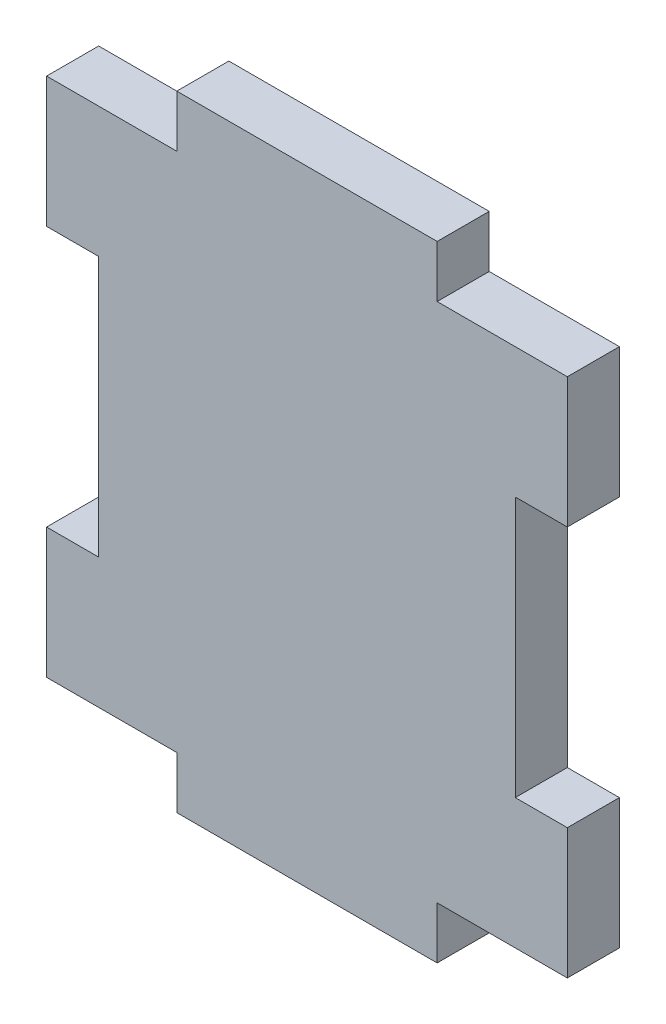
ISO-10303-21;
HEADER;
FILE_DESCRIPTION(('STEP AP214'),'2;1');
FILE_NAME('part.step','',(''),(''),'','','');
FILE_SCHEMA(('AUTOMOTIVE_DESIGN { 1 0 10303 214 1 1 1 1 }'));
ENDSEC;
DATA;
#1=APPLICATION_CONTEXT('core data for automotive mechanical design processes');
#2=APPLICATION_PROTOCOL_DEFINITION('international standard','automotive_design',2000,#1);
#3=PRODUCT_CONTEXT('',#1,'mechanical');
#4=PRODUCT('Part','Part','',(#3));
#5=PRODUCT_RELATED_PRODUCT_CATEGORY('part','',(#4));
#6=PRODUCT_DEFINITION_FORMATION('','',#4);
#7=PRODUCT_DEFINITION_CONTEXT('part definition',#1,'design');
#8=PRODUCT_DEFINITION('design','',#6,#7);
#9=PRODUCT_DEFINITION_SHAPE('','',#8);
#10=(LENGTH_UNIT() NAMED_UNIT(*) SI_UNIT(.MILLI.,.METRE.));
#11=(NAMED_UNIT(*) PLANE_ANGLE_UNIT() SI_UNIT($,.RADIAN.));
#12=(NAMED_UNIT(*) SI_UNIT($,.STERADIAN.) SOLID_ANGLE_UNIT());
#13=UNCERTAINTY_MEASURE_WITH_UNIT(LENGTH_MEASURE(1.E-05),#10,'distance_accuracy_value','');
#14=(GEOMETRIC_REPRESENTATION_CONTEXT(3) GLOBAL_UNCERTAINTY_ASSIGNED_CONTEXT((#13)) GLOBAL_UNIT_ASSIGNED_CONTEXT((#10,
#11,#12)) REPRESENTATION_CONTEXT('',''));
#15=CARTESIAN_POINT('',(0.,0.,0.));
#16=DIRECTION('',(0.,0.,1.));
#17=DIRECTION('',(1.,0.,0.));
#18=AXIS2_PLACEMENT_3D('',#15,#16,#17);
#19=CARTESIAN_POINT('',(7.5,33.,3.));
#20=DIRECTION('',(0.,-1.,0.));
#21=DIRECTION('',(0.,0.,-1.));
#22=AXIS2_PLACEMENT_3D('',#19,#20,#21);
#23=PLANE('',#22);
#24=DIRECTION('',(-1.,0.,0.));
#25=VECTOR('',#24,1.);
#26=CARTESIAN_POINT('',(7.5,33.,0.));
#27=LINE('',#26,#25);
#28=CARTESIAN_POINT('',(7.5,33.,0.));
#29=VERTEX_POINT('',#28);
#30=CARTESIAN_POINT('',(0.,33.,0.));
#31=VERTEX_POINT('',#30);
#32=EDGE_CURVE('E212',#29,#31,#27,.T.);
#33=ORIENTED_EDGE('',*,*,#32,.T.);
#34=DIRECTION('',(0.,0.,-1.));
#35=VECTOR('',#34,1.);
#36=CARTESIAN_POINT('',(0.,33.,3.));
#37=LINE('',#36,#35);
#38=CARTESIAN_POINT('',(0.,33.,3.));
#39=VERTEX_POINT('',#38);
#40=EDGE_CURVE('E11',#39,#31,#37,.T.);
#41=ORIENTED_EDGE('',*,*,#40,.F.);
#42=DIRECTION('',(-1.,0.,0.));
#43=VECTOR('',#42,1.);
#44=CARTESIAN_POINT('',(7.5,33.,3.));
#45=LINE('',#44,#43);
#46=CARTESIAN_POINT('',(7.5,33.,3.));
#47=VERTEX_POINT('',#46);
#48=EDGE_CURVE('E270',#47,#39,#45,.T.);
#49=ORIENTED_EDGE('',*,*,#48,.F.);
#50=DIRECTION('',(0.,0.,-1.));
#51=VECTOR('',#50,1.);
#52=CARTESIAN_POINT('',(7.5,33.,3.));
#53=LINE('',#52,#51);
#54=EDGE_CURVE('E208',#47,#29,#53,.T.);
#55=ORIENTED_EDGE('',*,*,#54,.T.);
#56=EDGE_LOOP('',(#33,#41,#49,#55));
#57=FACE_BOUND('',#56,.T.);
#58=ADVANCED_FACE('F39',(#57),#23,.F.);
#59=CARTESIAN_POINT('',(0.,25.5,3.));
#60=DIRECTION('',(1.,0.,0.));
#61=DIRECTION('',(0.,0.,-1.));
#62=AXIS2_PLACEMENT_3D('',#59,#60,#61);
#63=PLANE('',#62);
#64=DIRECTION('',(0.,-1.,0.));
#65=VECTOR('',#64,1.);
#66=CARTESIAN_POINT('',(0.,25.5,0.));
#67=LINE('',#66,#65);
#68=CARTESIAN_POINT('',(0.,25.5,0.));
#69=VERTEX_POINT('',#68);
#70=EDGE_CURVE('E216',#31,#69,#67,.T.);
#71=ORIENTED_EDGE('',*,*,#70,.T.);
#72=DIRECTION('',(0.,0.,-1.));
#73=VECTOR('',#72,1.);
#74=CARTESIAN_POINT('',(0.,25.5,3.));
#75=LINE('',#74,#73);
#76=CARTESIAN_POINT('',(0.,25.5,3.));
#77=VERTEX_POINT('',#76);
#78=EDGE_CURVE('E48',#77,#69,#75,.T.);
#79=ORIENTED_EDGE('',*,*,#78,.F.);
#80=DIRECTION('',(0.,-1.,0.));
#81=VECTOR('',#80,1.);
#82=CARTESIAN_POINT('',(0.,25.5,3.));
#83=LINE('',#82,#81);
#84=EDGE_CURVE('E135',#39,#77,#83,.T.);
#85=ORIENTED_EDGE('',*,*,#84,.F.);
#86=ORIENTED_EDGE('',*,*,#40,.T.);
#87=EDGE_LOOP('',(#71,#79,#85,#86));
#88=FACE_BOUND('',#87,.T.);
#89=ADVANCED_FACE('F420',(#88),#63,.F.);
#90=CARTESIAN_POINT('',(3.,25.5,3.));
#91=DIRECTION('',(0.,1.,0.));
#92=DIRECTION('',(0.,0.,1.));
#93=AXIS2_PLACEMENT_3D('',#90,#91,#92);
#94=PLANE('',#93);
#95=DIRECTION('',(1.,0.,0.));
#96=VECTOR('',#95,1.);
#97=CARTESIAN_POINT('',(3.,25.5,0.));
#98=LINE('',#97,#96);
#99=CARTESIAN_POINT('',(3.,25.5,0.));
#100=VERTEX_POINT('',#99);
#101=EDGE_CURVE('E219',#69,#100,#98,.T.);
#102=ORIENTED_EDGE('',*,*,#101,.T.);
#103=DIRECTION('',(0.,0.,-1.));
#104=VECTOR('',#103,1.);
#105=CARTESIAN_POINT('',(3.,25.5,3.));
#106=LINE('',#105,#104);
#107=CARTESIAN_POINT('',(3.,25.5,3.));
#108=VERTEX_POINT('',#107);
#109=EDGE_CURVE('E329',#108,#100,#106,.T.);
#110=ORIENTED_EDGE('',*,*,#109,.F.);
#111=DIRECTION('',(1.,0.,0.));
#112=VECTOR('',#111,1.);
#113=CARTESIAN_POINT('',(3.,25.5,3.));
#114=LINE('',#113,#112);
#115=EDGE_CURVE('E339',#77,#108,#114,.T.);
#116=ORIENTED_EDGE('',*,*,#115,.F.);
#117=ORIENTED_EDGE('',*,*,#78,.T.);
#118=EDGE_LOOP('',(#102,#110,#116,#117));
#119=FACE_BOUND('',#118,.T.);
#120=ADVANCED_FACE('F337',(#119),#94,.F.);
#121=CARTESIAN_POINT('',(3.,25.5,3.));
#122=DIRECTION('',(1.,0.,0.));
#123=DIRECTION('',(0.,1.,0.));
#124=AXIS2_PLACEMENT_3D('',#121,#122,#123);
#125=PLANE('',#124);
#126=DIRECTION('',(0.,-1.,0.));
#127=VECTOR('',#126,1.);
#128=CARTESIAN_POINT('',(3.,25.5,0.));
#129=LINE('',#128,#127);
#130=CARTESIAN_POINT('',(3.,10.5,0.));
#131=VERTEX_POINT('',#130);
#132=EDGE_CURVE('E222',#100,#131,#129,.T.);
#133=ORIENTED_EDGE('',*,*,#132,.T.);
#134=DIRECTION('',(0.,0.,-1.));
#135=VECTOR('',#134,1.);
#136=CARTESIAN_POINT('',(3.,10.5,3.));
#137=LINE('',#136,#135);
#138=CARTESIAN_POINT('',(3.,10.5,3.));
#139=VERTEX_POINT('',#138);
#140=EDGE_CURVE('E325',#139,#131,#137,.T.);
#141=ORIENTED_EDGE('',*,*,#140,.F.);
#142=DIRECTION('',(0.,-1.,0.));
#143=VECTOR('',#142,1.);
#144=CARTESIAN_POINT('',(3.,25.5,3.));
#145=LINE('',#144,#143);
#146=EDGE_CURVE('E358',#108,#139,#145,.T.);
#147=ORIENTED_EDGE('',*,*,#146,.F.);
#148=ORIENTED_EDGE('',*,*,#109,.T.);
#149=EDGE_LOOP('',(#133,#141,#147,#148));
#150=FACE_BOUND('',#149,.T.);
#151=ADVANCED_FACE('F348',(#150),#125,.F.);
#152=CARTESIAN_POINT('',(3.,10.5,3.));
#153=DIRECTION('',(0.,-1.,0.));
#154=DIRECTION('',(0.,0.,-1.));
#155=AXIS2_PLACEMENT_3D('',#152,#153,#154);
#156=PLANE('',#155);
#157=DIRECTION('',(-1.,0.,0.));
#158=VECTOR('',#157,1.);
#159=CARTESIAN_POINT('',(3.,10.5,0.));
#160=LINE('',#159,#158);
#161=CARTESIAN_POINT('',(0.,10.5,0.));
#162=VERTEX_POINT('',#161);
#163=EDGE_CURVE('E225',#131,#162,#160,.T.);
#164=ORIENTED_EDGE('',*,*,#163,.T.);
#165=DIRECTION('',(0.,0.,-1.));
#166=VECTOR('',#165,1.);
#167=CARTESIAN_POINT('',(0.,10.5,3.));
#168=LINE('',#167,#166);
#169=CARTESIAN_POINT('',(0.,10.5,3.));
#170=VERTEX_POINT('',#169);
#171=EDGE_CURVE('E321',#170,#162,#168,.T.);
#172=ORIENTED_EDGE('',*,*,#171,.F.);
#173=DIRECTION('',(-1.,0.,0.));
#174=VECTOR('',#173,1.);
#175=CARTESIAN_POINT('',(3.,10.5,3.));
#176=LINE('',#175,#174);
#177=EDGE_CURVE('E354',#139,#170,#176,.T.);
#178=ORIENTED_EDGE('',*,*,#177,.F.);
#179=ORIENTED_EDGE('',*,*,#140,.T.);
#180=EDGE_LOOP('',(#164,#172,#178,#179));
#181=FACE_BOUND('',#180,.T.);
#182=ADVANCED_FACE('F352',(#181),#156,.F.);
#183=CARTESIAN_POINT('',(0.,3.,3.));
#184=DIRECTION('',(1.,0.,0.));
#185=DIRECTION('',(0.,0.,-1.));
#186=AXIS2_PLACEMENT_3D('',#183,#184,#185);
#187=PLANE('',#186);
#188=DIRECTION('',(0.,-1.,0.));
#189=VECTOR('',#188,1.);
#190=CARTESIAN_POINT('',(0.,3.,0.));
#191=LINE('',#190,#189);
#192=CARTESIAN_POINT('',(0.,3.,0.));
#193=VERTEX_POINT('',#192);
#194=EDGE_CURVE('E228',#162,#193,#191,.T.);
#195=ORIENTED_EDGE('',*,*,#194,.T.);
#196=DIRECTION('',(0.,0.,-1.));
#197=VECTOR('',#196,1.);
#198=CARTESIAN_POINT('',(0.,3.,3.));
#199=LINE('',#198,#197);
#200=CARTESIAN_POINT('',(0.,3.,3.));
#201=VERTEX_POINT('',#200);
#202=EDGE_CURVE('E317',#201,#193,#199,.T.);
#203=ORIENTED_EDGE('',*,*,#202,.F.);
#204=DIRECTION('',(0.,-1.,0.));
#205=VECTOR('',#204,1.);
#206=CARTESIAN_POINT('',(0.,3.,3.));
#207=LINE('',#206,#205);
#208=EDGE_CURVE('E357',#170,#201,#207,.T.);
#209=ORIENTED_EDGE('',*,*,#208,.F.);
#210=ORIENTED_EDGE('',*,*,#171,.T.);
#211=EDGE_LOOP('',(#195,#203,#209,#210));
#212=FACE_BOUND('',#211,.T.);
#213=ADVANCED_FACE('F433',(#212),#187,.F.);
#214=CARTESIAN_POINT('',(7.5,3.,3.));
#215=DIRECTION('',(0.,1.,0.));
#216=DIRECTION('',(0.,0.,1.));
#217=AXIS2_PLACEMENT_3D('',#214,#215,#216);
#218=PLANE('',#217);
#219=DIRECTION('',(1.,0.,0.));
#220=VECTOR('',#219,1.);
#221=CARTESIAN_POINT('',(7.5,3.,0.));
#222=LINE('',#221,#220);
#223=CARTESIAN_POINT('',(7.5,3.,0.));
#224=VERTEX_POINT('',#223);
#225=EDGE_CURVE('E231',#193,#224,#222,.T.);
#226=ORIENTED_EDGE('',*,*,#225,.T.);
#227=DIRECTION('',(0.,0.,-1.));
#228=VECTOR('',#227,1.);
#229=CARTESIAN_POINT('',(7.5,3.,3.));
#230=LINE('',#229,#228);
#231=CARTESIAN_POINT('',(7.5,3.,3.));
#232=VERTEX_POINT('',#231);
#233=EDGE_CURVE('E313',#232,#224,#230,.T.);
#234=ORIENTED_EDGE('',*,*,#233,.F.);
#235=DIRECTION('',(1.,0.,0.));
#236=VECTOR('',#235,1.);
#237=CARTESIAN_POINT('',(7.5,3.,3.));
#238=LINE('',#237,#236);
#239=EDGE_CURVE('E362',#201,#232,#238,.T.);
#240=ORIENTED_EDGE('',*,*,#239,.F.);
#241=ORIENTED_EDGE('',*,*,#202,.T.);
#242=EDGE_LOOP('',(#226,#234,#240,#241));
#243=FACE_BOUND('',#242,.T.);
#244=ADVANCED_FACE('F436',(#243),#218,.F.);
#245=CARTESIAN_POINT('',(7.5,3.,3.));
#246=DIRECTION('',(1.,0.,0.));
#247=DIRECTION('',(0.,0.,-1.));
#248=AXIS2_PLACEMENT_3D('',#245,#246,#247);
#249=PLANE('',#248);
#250=DIRECTION('',(0.,-1.,0.));
#251=VECTOR('',#250,1.);
#252=CARTESIAN_POINT('',(7.5,3.,0.));
#253=LINE('',#252,#251);
#254=CARTESIAN_POINT('',(7.5,0.,0.));
#255=VERTEX_POINT('',#254);
#256=EDGE_CURVE('E234',#224,#255,#253,.T.);
#257=ORIENTED_EDGE('',*,*,#256,.T.);
#258=DIRECTION('',(0.,0.,-1.));
#259=VECTOR('',#258,1.);
#260=CARTESIAN_POINT('',(7.5,0.,3.));
#261=LINE('',#260,#259);
#262=CARTESIAN_POINT('',(7.5,0.,3.));
#263=VERTEX_POINT('',#262);
#264=EDGE_CURVE('E309',#263,#255,#261,.T.);
#265=ORIENTED_EDGE('',*,*,#264,.F.);
#266=DIRECTION('',(0.,-1.,0.));
#267=VECTOR('',#266,1.);
#268=CARTESIAN_POINT('',(7.5,3.,3.));
#269=LINE('',#268,#267);
#270=EDGE_CURVE('E369',#232,#263,#269,.T.);
#271=ORIENTED_EDGE('',*,*,#270,.F.);
#272=ORIENTED_EDGE('',*,*,#233,.T.);
#273=EDGE_LOOP('',(#257,#265,#271,#272));
#274=FACE_BOUND('',#273,.T.);
#275=ADVANCED_FACE('F440',(#274),#249,.F.);
#276=CARTESIAN_POINT('',(7.5,0.,3.));
#277=DIRECTION('',(0.,1.,0.));
#278=DIRECTION('',(0.,0.,1.));
#279=AXIS2_PLACEMENT_3D('',#276,#277,#278);
#280=PLANE('',#279);
#281=DIRECTION('',(1.,0.,0.));
#282=VECTOR('',#281,1.);
#283=CARTESIAN_POINT('',(7.5,0.,0.));
#284=LINE('',#283,#282);
#285=CARTESIAN_POINT('',(22.5,0.,0.));
#286=VERTEX_POINT('',#285);
#287=EDGE_CURVE('E237',#255,#286,#284,.T.);
#288=ORIENTED_EDGE('',*,*,#287,.T.);
#289=DIRECTION('',(0.,0.,-1.));
#290=VECTOR('',#289,1.);
#291=CARTESIAN_POINT('',(22.5,0.,3.));
#292=LINE('',#291,#290);
#293=CARTESIAN_POINT('',(22.5,0.,3.));
#294=VERTEX_POINT('',#293);
#295=EDGE_CURVE('E305',#294,#286,#292,.T.);
#296=ORIENTED_EDGE('',*,*,#295,.F.);
#297=DIRECTION('',(1.,0.,0.));
#298=VECTOR('',#297,1.);
#299=CARTESIAN_POINT('',(7.5,0.,3.));
#300=LINE('',#299,#298);
#301=EDGE_CURVE('E372',#263,#294,#300,.T.);
#302=ORIENTED_EDGE('',*,*,#301,.F.);
#303=ORIENTED_EDGE('',*,*,#264,.T.);
#304=EDGE_LOOP('',(#288,#296,#302,#303));
#305=FACE_BOUND('',#304,.T.);
#306=ADVANCED_FACE('F444',(#305),#280,.F.);
#307=CARTESIAN_POINT('',(22.5,3.,3.));
#308=DIRECTION('',(-1.,0.,0.));
#309=DIRECTION('',(0.,0.,1.));
#310=AXIS2_PLACEMENT_3D('',#307,#308,#309);
#311=PLANE('',#310);
#312=DIRECTION('',(0.,1.,0.));
#313=VECTOR('',#312,1.);
#314=CARTESIAN_POINT('',(22.5,3.,0.));
#315=LINE('',#314,#313);
#316=CARTESIAN_POINT('',(22.5,3.,0.));
#317=VERTEX_POINT('',#316);
#318=EDGE_CURVE('E240',#286,#317,#315,.T.);
#319=ORIENTED_EDGE('',*,*,#318,.T.);
#320=DIRECTION('',(0.,0.,-1.));
#321=VECTOR('',#320,1.);
#322=CARTESIAN_POINT('',(22.5,3.,3.));
#323=LINE('',#322,#321);
#324=CARTESIAN_POINT('',(22.5,3.,3.));
#325=VERTEX_POINT('',#324);
#326=EDGE_CURVE('E301',#325,#317,#323,.T.);
#327=ORIENTED_EDGE('',*,*,#326,.F.);
#328=DIRECTION('',(0.,1.,0.));
#329=VECTOR('',#328,1.);
#330=CARTESIAN_POINT('',(22.5,3.,3.));
#331=LINE('',#330,#329);
#332=EDGE_CURVE('E375',#294,#325,#331,.T.);
#333=ORIENTED_EDGE('',*,*,#332,.F.);
#334=ORIENTED_EDGE('',*,*,#295,.T.);
#335=EDGE_LOOP('',(#319,#327,#333,#334));
#336=FACE_BOUND('',#335,.T.);
#337=ADVANCED_FACE('F448',(#336),#311,.F.);
#338=CARTESIAN_POINT('',(22.5,3.,3.));
#339=DIRECTION('',(0.,1.,0.));
#340=DIRECTION('',(0.,0.,1.));
#341=AXIS2_PLACEMENT_3D('',#338,#339,#340);
#342=PLANE('',#341);
#343=DIRECTION('',(1.,0.,0.));
#344=VECTOR('',#343,1.);
#345=CARTESIAN_POINT('',(22.5,3.,0.));
#346=LINE('',#345,#344);
#347=CARTESIAN_POINT('',(30.,3.,0.));
#348=VERTEX_POINT('',#347);
#349=EDGE_CURVE('E243',#317,#348,#346,.T.);
#350=ORIENTED_EDGE('',*,*,#349,.T.);
#351=DIRECTION('',(0.,0.,-1.));
#352=VECTOR('',#351,1.);
#353=CARTESIAN_POINT('',(30.,3.,3.));
#354=LINE('',#353,#352);
#355=CARTESIAN_POINT('',(30.,3.,3.));
#356=VERTEX_POINT('',#355);
#357=EDGE_CURVE('E297',#356,#348,#354,.T.);
#358=ORIENTED_EDGE('',*,*,#357,.F.);
#359=DIRECTION('',(1.,0.,0.));
#360=VECTOR('',#359,1.);
#361=CARTESIAN_POINT('',(22.5,3.,3.));
#362=LINE('',#361,#360);
#363=EDGE_CURVE('E378',#325,#356,#362,.T.);
#364=ORIENTED_EDGE('',*,*,#363,.F.);
#365=ORIENTED_EDGE('',*,*,#326,.T.);
#366=EDGE_LOOP('',(#350,#358,#364,#365));
#367=FACE_BOUND('',#366,.T.);
#368=ADVANCED_FACE('F452',(#367),#342,.F.);
#369=CARTESIAN_POINT('',(30.,3.,3.));
#370=DIRECTION('',(-1.,0.,0.));
#371=DIRECTION('',(0.,0.,1.));
#372=AXIS2_PLACEMENT_3D('',#369,#370,#371);
#373=PLANE('',#372);
#374=DIRECTION('',(0.,1.,0.));
#375=VECTOR('',#374,1.);
#376=CARTESIAN_POINT('',(30.,3.,0.));
#377=LINE('',#376,#375);
#378=CARTESIAN_POINT('',(30.,10.5,0.));
#379=VERTEX_POINT('',#378);
#380=EDGE_CURVE('E246',#348,#379,#377,.T.);
#381=ORIENTED_EDGE('',*,*,#380,.T.);
#382=DIRECTION('',(0.,0.,-1.));
#383=VECTOR('',#382,1.);
#384=CARTESIAN_POINT('',(30.,10.5,3.));
#385=LINE('',#384,#383);
#386=CARTESIAN_POINT('',(30.,10.5,3.));
#387=VERTEX_POINT('',#386);
#388=EDGE_CURVE('E293',#387,#379,#385,.T.);
#389=ORIENTED_EDGE('',*,*,#388,.F.);
#390=DIRECTION('',(0.,1.,0.));
#391=VECTOR('',#390,1.);
#392=CARTESIAN_POINT('',(30.,3.,3.));
#393=LINE('',#392,#391);
#394=EDGE_CURVE('E381',#356,#387,#393,.T.);
#395=ORIENTED_EDGE('',*,*,#394,.F.);
#396=ORIENTED_EDGE('',*,*,#357,.T.);
#397=EDGE_LOOP('',(#381,#389,#395,#396));
#398=FACE_BOUND('',#397,.T.);
#399=ADVANCED_FACE('F456',(#398),#373,.F.);
#400=CARTESIAN_POINT('',(27.,10.5,3.));
#401=DIRECTION('',(0.,-1.,0.));
#402=DIRECTION('',(0.,0.,-1.));
#403=AXIS2_PLACEMENT_3D('',#400,#401,#402);
#404=PLANE('',#403);
#405=DIRECTION('',(-1.,0.,0.));
#406=VECTOR('',#405,1.);
#407=CARTESIAN_POINT('',(27.,10.5,0.));
#408=LINE('',#407,#406);
#409=CARTESIAN_POINT('',(27.,10.5,0.));
#410=VERTEX_POINT('',#409);
#411=EDGE_CURVE('E249',#379,#410,#408,.T.);
#412=ORIENTED_EDGE('',*,*,#411,.T.);
#413=DIRECTION('',(0.,0.,-1.));
#414=VECTOR('',#413,1.);
#415=CARTESIAN_POINT('',(27.,10.5,3.));
#416=LINE('',#415,#414);
#417=CARTESIAN_POINT('',(27.,10.5,3.));
#418=VERTEX_POINT('',#417);
#419=EDGE_CURVE('E289',#418,#410,#416,.T.);
#420=ORIENTED_EDGE('',*,*,#419,.F.);
#421=DIRECTION('',(-1.,0.,0.));
#422=VECTOR('',#421,1.);
#423=CARTESIAN_POINT('',(27.,10.5,3.));
#424=LINE('',#423,#422);
#425=EDGE_CURVE('E384',#387,#418,#424,.T.);
#426=ORIENTED_EDGE('',*,*,#425,.F.);
#427=ORIENTED_EDGE('',*,*,#388,.T.);
#428=EDGE_LOOP('',(#412,#420,#426,#427));
#429=FACE_BOUND('',#428,.T.);
#430=ADVANCED_FACE('F460',(#429),#404,.F.);
#431=CARTESIAN_POINT('',(27.,25.5,3.));
#432=DIRECTION('',(-1.,0.,0.));
#433=DIRECTION('',(0.,-1.,0.));
#434=AXIS2_PLACEMENT_3D('',#431,#432,#433);
#435=PLANE('',#434);
#436=DIRECTION('',(0.,1.,0.));
#437=VECTOR('',#436,1.);
#438=CARTESIAN_POINT('',(27.,25.5,0.));
#439=LINE('',#438,#437);
#440=CARTESIAN_POINT('',(27.,25.5,0.));
#441=VERTEX_POINT('',#440);
#442=EDGE_CURVE('E252',#410,#441,#439,.T.);
#443=ORIENTED_EDGE('',*,*,#442,.T.);
#444=DIRECTION('',(0.,0.,-1.));
#445=VECTOR('',#444,1.);
#446=CARTESIAN_POINT('',(27.,25.5,3.));
#447=LINE('',#446,#445);
#448=CARTESIAN_POINT('',(27.,25.5,3.));
#449=VERTEX_POINT('',#448);
#450=EDGE_CURVE('E285',#449,#441,#447,.T.);
#451=ORIENTED_EDGE('',*,*,#450,.F.);
#452=DIRECTION('',(0.,1.,0.));
#453=VECTOR('',#452,1.);
#454=CARTESIAN_POINT('',(27.,25.5,3.));
#455=LINE('',#454,#453);
#456=EDGE_CURVE('E387',#418,#449,#455,.T.);
#457=ORIENTED_EDGE('',*,*,#456,.F.);
#458=ORIENTED_EDGE('',*,*,#419,.T.);
#459=EDGE_LOOP('',(#443,#451,#457,#458));
#460=FACE_BOUND('',#459,.T.);
#461=ADVANCED_FACE('F464',(#460),#435,.F.);
#462=CARTESIAN_POINT('',(27.,25.5,3.));
#463=DIRECTION('',(0.,1.,0.));
#464=DIRECTION('',(0.,0.,1.));
#465=AXIS2_PLACEMENT_3D('',#462,#463,#464);
#466=PLANE('',#465);
#467=DIRECTION('',(1.,0.,0.));
#468=VECTOR('',#467,1.);
#469=CARTESIAN_POINT('',(27.,25.5,0.));
#470=LINE('',#469,#468);
#471=CARTESIAN_POINT('',(30.,25.5,0.));
#472=VERTEX_POINT('',#471);
#473=EDGE_CURVE('E255',#441,#472,#470,.T.);
#474=ORIENTED_EDGE('',*,*,#473,.T.);
#475=DIRECTION('',(0.,0.,-1.));
#476=VECTOR('',#475,1.);
#477=CARTESIAN_POINT('',(30.,25.5,3.));
#478=LINE('',#477,#476);
#479=CARTESIAN_POINT('',(30.,25.5,3.));
#480=VERTEX_POINT('',#479);
#481=EDGE_CURVE('E281',#480,#472,#478,.T.);
#482=ORIENTED_EDGE('',*,*,#481,.F.);
#483=DIRECTION('',(1.,0.,0.));
#484=VECTOR('',#483,1.);
#485=CARTESIAN_POINT('',(27.,25.5,3.));
#486=LINE('',#485,#484);
#487=EDGE_CURVE('E390',#449,#480,#486,.T.);
#488=ORIENTED_EDGE('',*,*,#487,.F.);
#489=ORIENTED_EDGE('',*,*,#450,.T.);
#490=EDGE_LOOP('',(#474,#482,#488,#489));
#491=FACE_BOUND('',#490,.T.);
#492=ADVANCED_FACE('F468',(#491),#466,.F.);
#493=CARTESIAN_POINT('',(30.,25.5,3.));
#494=DIRECTION('',(-1.,0.,0.));
#495=DIRECTION('',(0.,0.,1.));
#496=AXIS2_PLACEMENT_3D('',#493,#494,#495);
#497=PLANE('',#496);
#498=DIRECTION('',(0.,1.,0.));
#499=VECTOR('',#498,1.);
#500=CARTESIAN_POINT('',(30.,25.5,0.));
#501=LINE('',#500,#499);
#502=CARTESIAN_POINT('',(30.,33.,0.));
#503=VERTEX_POINT('',#502);
#504=EDGE_CURVE('E258',#472,#503,#501,.T.);
#505=ORIENTED_EDGE('',*,*,#504,.T.);
#506=DIRECTION('',(0.,0.,-1.));
#507=VECTOR('',#506,1.);
#508=CARTESIAN_POINT('',(30.,33.,3.));
#509=LINE('',#508,#507);
#510=CARTESIAN_POINT('',(30.,33.,3.));
#511=VERTEX_POINT('',#510);
#512=EDGE_CURVE('E277',#511,#503,#509,.T.);
#513=ORIENTED_EDGE('',*,*,#512,.F.);
#514=DIRECTION('',(0.,1.,0.));
#515=VECTOR('',#514,1.);
#516=CARTESIAN_POINT('',(30.,25.5,3.));
#517=LINE('',#516,#515);
#518=EDGE_CURVE('E393',#480,#511,#517,.T.);
#519=ORIENTED_EDGE('',*,*,#518,.F.);
#520=ORIENTED_EDGE('',*,*,#481,.T.);
#521=EDGE_LOOP('',(#505,#513,#519,#520));
#522=FACE_BOUND('',#521,.T.);
#523=ADVANCED_FACE('F401',(#522),#497,.F.);
#524=CARTESIAN_POINT('',(22.5,33.,3.));
#525=DIRECTION('',(0.,-1.,0.));
#526=DIRECTION('',(0.,0.,-1.));
#527=AXIS2_PLACEMENT_3D('',#524,#525,#526);
#528=PLANE('',#527);
#529=DIRECTION('',(-1.,0.,0.));
#530=VECTOR('',#529,1.);
#531=CARTESIAN_POINT('',(22.5,33.,0.));
#532=LINE('',#531,#530);
#533=CARTESIAN_POINT('',(22.5,33.,0.));
#534=VERTEX_POINT('',#533);
#535=EDGE_CURVE('E261',#503,#534,#532,.T.);
#536=ORIENTED_EDGE('',*,*,#535,.T.);
#537=DIRECTION('',(0.,0.,-1.));
#538=VECTOR('',#537,1.);
#539=CARTESIAN_POINT('',(22.5,33.,3.));
#540=LINE('',#539,#538);
#541=CARTESIAN_POINT('',(22.5,33.,3.));
#542=VERTEX_POINT('',#541);
#543=EDGE_CURVE('E201',#542,#534,#540,.T.);
#544=ORIENTED_EDGE('',*,*,#543,.F.);
#545=DIRECTION('',(-1.,0.,0.));
#546=VECTOR('',#545,1.);
#547=CARTESIAN_POINT('',(22.5,33.,3.));
#548=LINE('',#547,#546);
#549=EDGE_CURVE('E190',#511,#542,#548,.T.);
#550=ORIENTED_EDGE('',*,*,#549,.F.);
#551=ORIENTED_EDGE('',*,*,#512,.T.);
#552=EDGE_LOOP('',(#536,#544,#550,#551));
#553=FACE_BOUND('',#552,.T.);
#554=ADVANCED_FACE('F405',(#553),#528,.F.);
#555=CARTESIAN_POINT('',(22.5,33.,3.));
#556=DIRECTION('',(-1.,0.,0.));
#557=DIRECTION('',(0.,0.,1.));
#558=AXIS2_PLACEMENT_3D('',#555,#556,#557);
#559=PLANE('',#558);
#560=DIRECTION('',(0.,1.,0.));
#561=VECTOR('',#560,1.);
#562=CARTESIAN_POINT('',(22.5,33.,0.));
#563=LINE('',#562,#561);
#564=CARTESIAN_POINT('',(22.5,36.,0.));
#565=VERTEX_POINT('',#564);
#566=EDGE_CURVE('E199',#534,#565,#563,.T.);
#567=ORIENTED_EDGE('',*,*,#566,.T.);
#568=DIRECTION('',(0.,0.,-1.));
#569=VECTOR('',#568,1.);
#570=CARTESIAN_POINT('',(22.5,36.,3.));
#571=LINE('',#570,#569);
#572=CARTESIAN_POINT('',(22.5,36.,3.));
#573=VERTEX_POINT('',#572);
#574=EDGE_CURVE('E196',#573,#565,#571,.T.);
#575=ORIENTED_EDGE('',*,*,#574,.F.);
#576=DIRECTION('',(0.,1.,0.));
#577=VECTOR('',#576,1.);
#578=CARTESIAN_POINT('',(22.5,33.,3.));
#579=LINE('',#578,#577);
#580=EDGE_CURVE('E184',#542,#573,#579,.T.);
#581=ORIENTED_EDGE('',*,*,#580,.F.);
#582=ORIENTED_EDGE('',*,*,#543,.T.);
#583=EDGE_LOOP('',(#567,#575,#581,#582));
#584=FACE_BOUND('',#583,.T.);
#585=ADVANCED_FACE('F197',(#584),#559,.F.);
#586=CARTESIAN_POINT('',(7.5,36.,3.));
#587=DIRECTION('',(0.,-1.,0.));
#588=DIRECTION('',(0.,0.,-1.));
#589=AXIS2_PLACEMENT_3D('',#586,#587,#588);
#590=PLANE('',#589);
#591=DIRECTION('',(-1.,0.,0.));
#592=VECTOR('',#591,1.);
#593=CARTESIAN_POINT('',(7.5,36.,0.));
#594=LINE('',#593,#592);
#595=CARTESIAN_POINT('',(7.5,36.,0.));
#596=VERTEX_POINT('',#595);
#597=EDGE_CURVE('E121',#565,#596,#594,.T.);
#598=ORIENTED_EDGE('',*,*,#597,.T.);
#599=DIRECTION('',(0.,0.,-1.));
#600=VECTOR('',#599,1.);
#601=CARTESIAN_POINT('',(7.5,36.,3.));
#602=LINE('',#601,#600);
#603=CARTESIAN_POINT('',(7.5,36.,3.));
#604=VERTEX_POINT('',#603);
#605=EDGE_CURVE('E202',#604,#596,#602,.T.);
#606=ORIENTED_EDGE('',*,*,#605,.F.);
#607=DIRECTION('',(-1.,0.,0.));
#608=VECTOR('',#607,1.);
#609=CARTESIAN_POINT('',(7.5,36.,3.));
#610=LINE('',#609,#608);
#611=EDGE_CURVE('E188',#573,#604,#610,.T.);
#612=ORIENTED_EDGE('',*,*,#611,.F.);
#613=ORIENTED_EDGE('',*,*,#574,.T.);
#614=EDGE_LOOP('',(#598,#606,#612,#613));
#615=FACE_BOUND('',#614,.T.);
#616=ADVANCED_FACE('F204',(#615),#590,.F.);
#617=CARTESIAN_POINT('',(7.5,33.,3.));
#618=DIRECTION('',(1.,0.,0.));
#619=DIRECTION('',(0.,0.,-1.));
#620=AXIS2_PLACEMENT_3D('',#617,#618,#619);
#621=PLANE('',#620);
#622=DIRECTION('',(0.,-1.,0.));
#623=VECTOR('',#622,1.);
#624=CARTESIAN_POINT('',(7.5,33.,0.));
#625=LINE('',#624,#623);
#626=EDGE_CURVE('E127',#596,#29,#625,.T.);
#627=ORIENTED_EDGE('',*,*,#626,.T.);
#628=ORIENTED_EDGE('',*,*,#54,.F.);
#629=DIRECTION('',(0.,-1.,0.));
#630=VECTOR('',#629,1.);
#631=CARTESIAN_POINT('',(7.5,33.,3.));
#632=LINE('',#631,#630);
#633=EDGE_CURVE('E56',#604,#47,#632,.T.);
#634=ORIENTED_EDGE('',*,*,#633,.F.);
#635=ORIENTED_EDGE('',*,*,#605,.T.);
#636=EDGE_LOOP('',(#627,#628,#634,#635));
#637=FACE_BOUND('',#636,.T.);
#638=ADVANCED_FACE('F409',(#637),#621,.F.);
#639=CARTESIAN_POINT('',(0.,0.,3.));
#640=DIRECTION('',(0.,0.,-1.));
#641=DIRECTION('',(-1.,0.,0.));
#642=AXIS2_PLACEMENT_3D('',#639,#640,#641);
#643=PLANE('',#642);
#644=ORIENTED_EDGE('',*,*,#48,.T.);
#645=ORIENTED_EDGE('',*,*,#84,.T.);
#646=ORIENTED_EDGE('',*,*,#115,.T.);
#647=ORIENTED_EDGE('',*,*,#146,.T.);
#648=ORIENTED_EDGE('',*,*,#177,.T.);
#649=ORIENTED_EDGE('',*,*,#208,.T.);
#650=ORIENTED_EDGE('',*,*,#239,.T.);
#651=ORIENTED_EDGE('',*,*,#270,.T.);
#652=ORIENTED_EDGE('',*,*,#301,.T.);
#653=ORIENTED_EDGE('',*,*,#332,.T.);
#654=ORIENTED_EDGE('',*,*,#363,.T.);
#655=ORIENTED_EDGE('',*,*,#394,.T.);
#656=ORIENTED_EDGE('',*,*,#425,.T.);
#657=ORIENTED_EDGE('',*,*,#456,.T.);
#658=ORIENTED_EDGE('',*,*,#487,.T.);
#659=ORIENTED_EDGE('',*,*,#518,.T.);
#660=ORIENTED_EDGE('',*,*,#549,.T.);
#661=ORIENTED_EDGE('',*,*,#580,.T.);
#662=ORIENTED_EDGE('',*,*,#611,.T.);
#663=ORIENTED_EDGE('',*,*,#633,.T.);
#664=EDGE_LOOP('',(#644,#645,#646,#647,#648,#649,#650,#651,#652,#653,#654,#655,#656,#657,#658,
#659,#660,#661,#662,#663));
#665=FACE_BOUND('',#664,.T.);
#666=ADVANCED_FACE('F186',(#665),#643,.F.);
#667=CARTESIAN_POINT('',(0.,0.,0.));
#668=DIRECTION('',(0.,0.,-1.));
#669=DIRECTION('',(-1.,0.,0.));
#670=AXIS2_PLACEMENT_3D('',#667,#668,#669);
#671=PLANE('',#670);
#672=ORIENTED_EDGE('',*,*,#32,.F.);
#673=ORIENTED_EDGE('',*,*,#626,.F.);
#674=ORIENTED_EDGE('',*,*,#597,.F.);
#675=ORIENTED_EDGE('',*,*,#566,.F.);
#676=ORIENTED_EDGE('',*,*,#535,.F.);
#677=ORIENTED_EDGE('',*,*,#504,.F.);
#678=ORIENTED_EDGE('',*,*,#473,.F.);
#679=ORIENTED_EDGE('',*,*,#442,.F.);
#680=ORIENTED_EDGE('',*,*,#411,.F.);
#681=ORIENTED_EDGE('',*,*,#380,.F.);
#682=ORIENTED_EDGE('',*,*,#349,.F.);
#683=ORIENTED_EDGE('',*,*,#318,.F.);
#684=ORIENTED_EDGE('',*,*,#287,.F.);
#685=ORIENTED_EDGE('',*,*,#256,.F.);
#686=ORIENTED_EDGE('',*,*,#225,.F.);
#687=ORIENTED_EDGE('',*,*,#194,.F.);
#688=ORIENTED_EDGE('',*,*,#163,.F.);
#689=ORIENTED_EDGE('',*,*,#132,.F.);
#690=ORIENTED_EDGE('',*,*,#101,.F.);
#691=ORIENTED_EDGE('',*,*,#70,.F.);
#692=EDGE_LOOP('',(#672,#673,#674,#675,#676,#677,#678,#679,#680,#681,#682,#683,#684,#685,#686,
#687,#688,#689,#690,#691));
#693=FACE_BOUND('',#692,.T.);
#694=ADVANCED_FACE('F343',(#693),#671,.T.);
#695=CLOSED_SHELL('',(#58,#89,#120,#151,#182,#213,#244,#275,#306,#337,#368,#399,#430,#461,#492,
#523,#554,#585,#616,#638,#666,#694));
#696=MANIFOLD_SOLID_BREP('B2',#695);
#697=ADVANCED_BREP_SHAPE_REPRESENTATION('',(#18,#696),#14);
#698=SHAPE_DEFINITION_REPRESENTATION(#9,#697);
ENDSEC;
END-ISO-10303-21;
